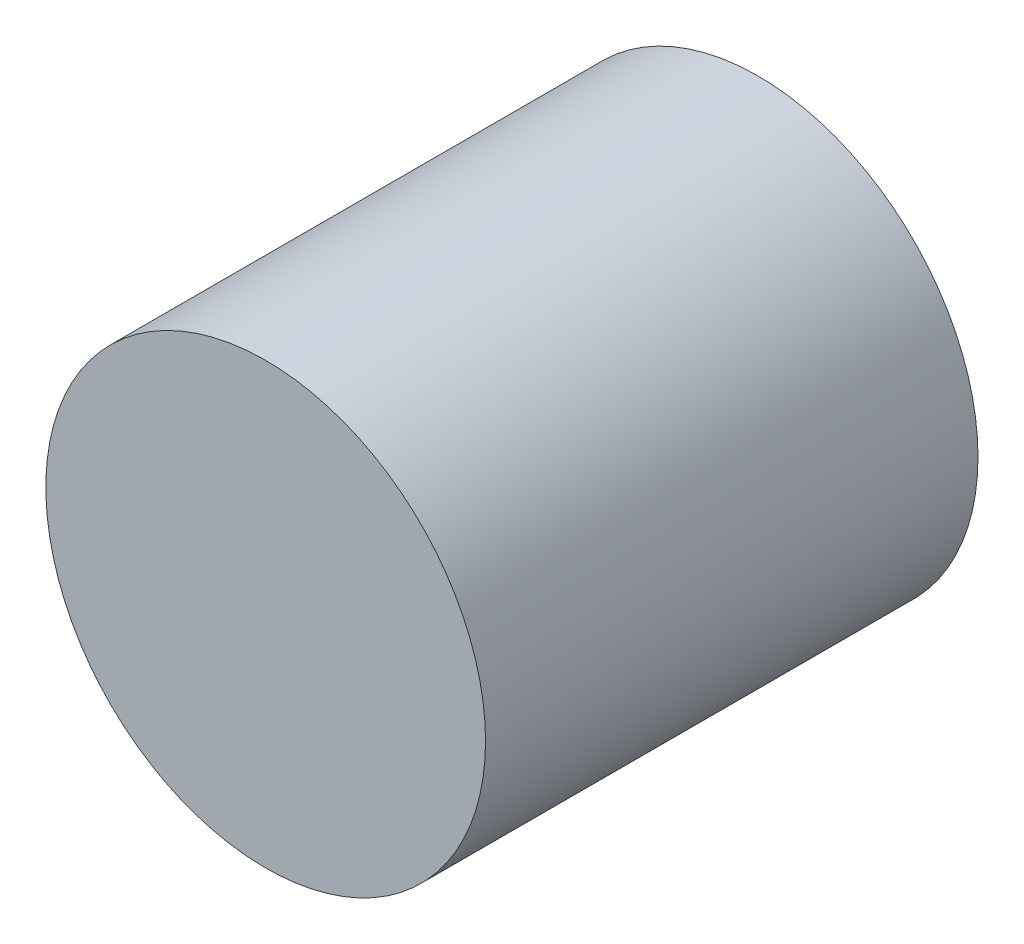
from build123d import *

# Parameters (mm, degrees)
ESQUISSE1_R      = 25
EXTRUSION1_DEPTH = 56


with BuildPart() as part:
    # Esquisse1 → Extrusion1 (new body)
    with BuildSketch(Plane.XY):
        Circle(ESQUISSE1_R)
    extrude(amount=EXTRUSION1_DEPTH)


solid = part.part
